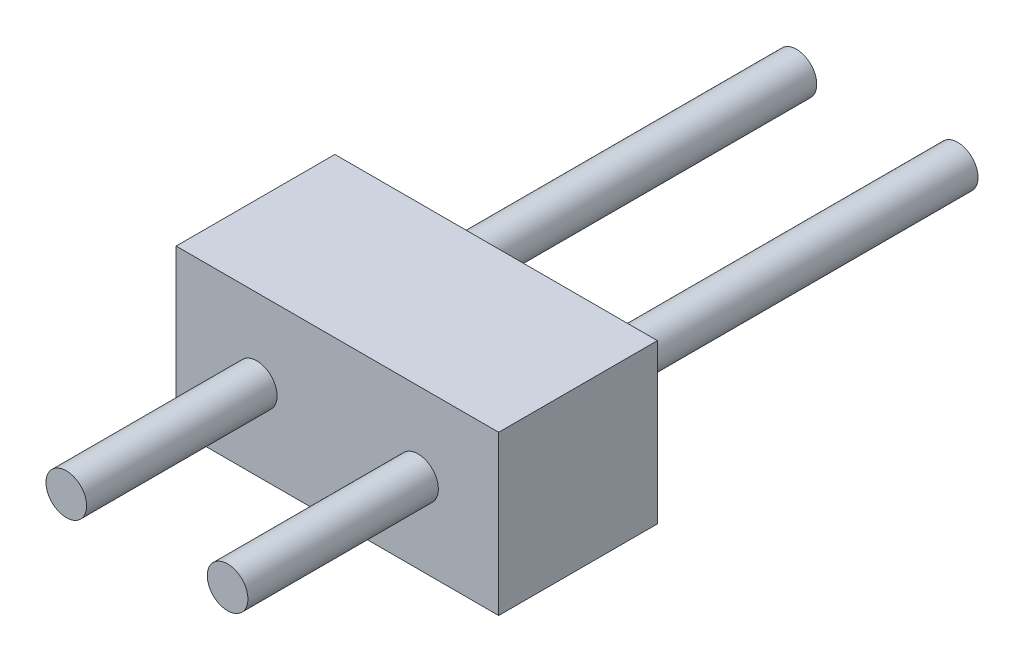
ISO-10303-21;
HEADER;
FILE_DESCRIPTION(('STEP AP214'),'2;1');
FILE_NAME('part.step','',(''),(''),'','','');
FILE_SCHEMA(('AUTOMOTIVE_DESIGN { 1 0 10303 214 1 1 1 1 }'));
ENDSEC;
DATA;
#1=APPLICATION_CONTEXT('core data for automotive mechanical design processes');
#2=APPLICATION_PROTOCOL_DEFINITION('international standard','automotive_design',2000,#1);
#3=PRODUCT_CONTEXT('',#1,'mechanical');
#4=PRODUCT('Part','Part','',(#3));
#5=PRODUCT_RELATED_PRODUCT_CATEGORY('part','',(#4));
#6=PRODUCT_DEFINITION_FORMATION('','',#4);
#7=PRODUCT_DEFINITION_CONTEXT('part definition',#1,'design');
#8=PRODUCT_DEFINITION('design','',#6,#7);
#9=PRODUCT_DEFINITION_SHAPE('','',#8);
#10=(LENGTH_UNIT() NAMED_UNIT(*) SI_UNIT(.MILLI.,.METRE.));
#11=(NAMED_UNIT(*) PLANE_ANGLE_UNIT() SI_UNIT($,.RADIAN.));
#12=(NAMED_UNIT(*) SI_UNIT($,.STERADIAN.) SOLID_ANGLE_UNIT());
#13=UNCERTAINTY_MEASURE_WITH_UNIT(LENGTH_MEASURE(1.E-05),#10,'distance_accuracy_value','');
#14=(GEOMETRIC_REPRESENTATION_CONTEXT(3) GLOBAL_UNCERTAINTY_ASSIGNED_CONTEXT((#13)) GLOBAL_UNIT_ASSIGNED_CONTEXT((#10,
#11,#12)) REPRESENTATION_CONTEXT('',''));
#15=CARTESIAN_POINT('',(0.,0.,0.));
#16=DIRECTION('',(0.,0.,1.));
#17=DIRECTION('',(1.,0.,0.));
#18=AXIS2_PLACEMENT_3D('',#15,#16,#17);
#19=CARTESIAN_POINT('',(0.,0.,2.5));
#20=DIRECTION('',(1.,0.,0.));
#21=DIRECTION('',(0.,0.,-1.));
#22=AXIS2_PLACEMENT_3D('',#19,#20,#21);
#23=PLANE('',#22);
#24=DIRECTION('',(0.,-1.,0.));
#25=VECTOR('',#24,1.);
#26=CARTESIAN_POINT('',(0.,0.,0.));
#27=LINE('',#26,#25);
#28=CARTESIAN_POINT('',(0.,2.5,0.));
#29=VERTEX_POINT('',#28);
#30=CARTESIAN_POINT('',(0.,0.,0.));
#31=VERTEX_POINT('',#30);
#32=EDGE_CURVE('E102',#29,#31,#27,.T.);
#33=ORIENTED_EDGE('',*,*,#32,.T.);
#34=DIRECTION('',(0.,0.,-1.));
#35=VECTOR('',#34,1.);
#36=CARTESIAN_POINT('',(0.,0.,2.5));
#37=LINE('',#36,#35);
#38=CARTESIAN_POINT('',(0.,0.,2.5));
#39=VERTEX_POINT('',#38);
#40=EDGE_CURVE('E93',#39,#31,#37,.T.);
#41=ORIENTED_EDGE('',*,*,#40,.F.);
#42=DIRECTION('',(0.,-1.,0.));
#43=VECTOR('',#42,1.);
#44=CARTESIAN_POINT('',(0.,0.,2.5));
#45=LINE('',#44,#43);
#46=CARTESIAN_POINT('',(0.,2.5,2.5));
#47=VERTEX_POINT('',#46);
#48=EDGE_CURVE('E87',#47,#39,#45,.T.);
#49=ORIENTED_EDGE('',*,*,#48,.F.);
#50=DIRECTION('',(0.,0.,-1.));
#51=VECTOR('',#50,1.);
#52=CARTESIAN_POINT('',(0.,2.5,2.5));
#53=LINE('',#52,#51);
#54=EDGE_CURVE('E98',#47,#29,#53,.T.);
#55=ORIENTED_EDGE('',*,*,#54,.T.);
#56=EDGE_LOOP('',(#33,#41,#49,#55));
#57=FACE_BOUND('',#56,.T.);
#58=ADVANCED_FACE('F35',(#57),#23,.F.);
#59=CARTESIAN_POINT('',(0.,0.,2.5));
#60=DIRECTION('',(0.,1.,0.));
#61=DIRECTION('',(0.,0.,1.));
#62=AXIS2_PLACEMENT_3D('',#59,#60,#61);
#63=PLANE('',#62);
#64=DIRECTION('',(1.,0.,0.));
#65=VECTOR('',#64,1.);
#66=CARTESIAN_POINT('',(0.,0.,0.));
#67=LINE('',#66,#65);
#68=CARTESIAN_POINT('',(5.08,0.,0.));
#69=VERTEX_POINT('',#68);
#70=EDGE_CURVE('E92',#31,#69,#67,.T.);
#71=ORIENTED_EDGE('',*,*,#70,.T.);
#72=DIRECTION('',(0.,0.,-1.));
#73=VECTOR('',#72,1.);
#74=CARTESIAN_POINT('',(5.08,0.,2.5));
#75=LINE('',#74,#73);
#76=CARTESIAN_POINT('',(5.08,0.,2.5));
#77=VERTEX_POINT('',#76);
#78=EDGE_CURVE('E90',#77,#69,#75,.T.);
#79=ORIENTED_EDGE('',*,*,#78,.F.);
#80=DIRECTION('',(1.,0.,0.));
#81=VECTOR('',#80,1.);
#82=CARTESIAN_POINT('',(0.,0.,2.5));
#83=LINE('',#82,#81);
#84=EDGE_CURVE('E82',#39,#77,#83,.T.);
#85=ORIENTED_EDGE('',*,*,#84,.F.);
#86=ORIENTED_EDGE('',*,*,#40,.T.);
#87=EDGE_LOOP('',(#71,#79,#85,#86));
#88=FACE_BOUND('',#87,.T.);
#89=ADVANCED_FACE('F91',(#88),#63,.F.);
#90=CARTESIAN_POINT('',(5.08,0.,2.5));
#91=DIRECTION('',(-1.,0.,0.));
#92=DIRECTION('',(0.,0.,1.));
#93=AXIS2_PLACEMENT_3D('',#90,#91,#92);
#94=PLANE('',#93);
#95=DIRECTION('',(0.,1.,0.));
#96=VECTOR('',#95,1.);
#97=CARTESIAN_POINT('',(5.08,0.,0.));
#98=LINE('',#97,#96);
#99=CARTESIAN_POINT('',(5.08,2.5,0.));
#100=VERTEX_POINT('',#99);
#101=EDGE_CURVE('E68',#69,#100,#98,.T.);
#102=ORIENTED_EDGE('',*,*,#101,.T.);
#103=DIRECTION('',(0.,0.,-1.));
#104=VECTOR('',#103,1.);
#105=CARTESIAN_POINT('',(5.08,2.5,2.5));
#106=LINE('',#105,#104);
#107=CARTESIAN_POINT('',(5.08,2.5,2.5));
#108=VERTEX_POINT('',#107);
#109=EDGE_CURVE('E94',#108,#100,#106,.T.);
#110=ORIENTED_EDGE('',*,*,#109,.F.);
#111=DIRECTION('',(0.,1.,0.));
#112=VECTOR('',#111,1.);
#113=CARTESIAN_POINT('',(5.08,0.,2.5));
#114=LINE('',#113,#112);
#115=EDGE_CURVE('E85',#77,#108,#114,.T.);
#116=ORIENTED_EDGE('',*,*,#115,.F.);
#117=ORIENTED_EDGE('',*,*,#78,.T.);
#118=EDGE_LOOP('',(#102,#110,#116,#117));
#119=FACE_BOUND('',#118,.T.);
#120=ADVANCED_FACE('F96',(#119),#94,.F.);
#121=CARTESIAN_POINT('',(0.,2.5,2.5));
#122=DIRECTION('',(0.,-1.,0.));
#123=DIRECTION('',(0.,0.,-1.));
#124=AXIS2_PLACEMENT_3D('',#121,#122,#123);
#125=PLANE('',#124);
#126=DIRECTION('',(-1.,0.,0.));
#127=VECTOR('',#126,1.);
#128=CARTESIAN_POINT('',(0.,2.5,0.));
#129=LINE('',#128,#127);
#130=EDGE_CURVE('E74',#100,#29,#129,.T.);
#131=ORIENTED_EDGE('',*,*,#130,.T.);
#132=ORIENTED_EDGE('',*,*,#54,.F.);
#133=DIRECTION('',(-1.,0.,0.));
#134=VECTOR('',#133,1.);
#135=CARTESIAN_POINT('',(0.,2.5,2.5));
#136=LINE('',#135,#134);
#137=EDGE_CURVE('E51',#108,#47,#136,.T.);
#138=ORIENTED_EDGE('',*,*,#137,.F.);
#139=ORIENTED_EDGE('',*,*,#109,.T.);
#140=EDGE_LOOP('',(#131,#132,#138,#139));
#141=FACE_BOUND('',#140,.T.);
#142=ADVANCED_FACE('F118',(#141),#125,.F.);
#143=CARTESIAN_POINT('',(0.,0.,2.5));
#144=DIRECTION('',(0.,0.,-1.));
#145=DIRECTION('',(-1.,0.,0.));
#146=AXIS2_PLACEMENT_3D('',#143,#144,#145);
#147=PLANE('',#146);
#148=CARTESIAN_POINT('',(3.81,1.25,2.5));
#149=DIRECTION('',(0.,0.,-1.));
#150=DIRECTION('',(-1.,0.,0.));
#151=AXIS2_PLACEMENT_3D('',#148,#149,#150);
#152=CIRCLE('',#151,0.32);
#153=CARTESIAN_POINT('',(3.49,1.25,2.5));
#154=VERTEX_POINT('',#153);
#155=EDGE_CURVE('E11',#154,#154,#152,.F.);
#156=ORIENTED_EDGE('',*,*,#155,.F.);
#157=EDGE_LOOP('',(#156));
#158=FACE_BOUND('',#157,.T.);
#159=CARTESIAN_POINT('',(1.27,1.25,2.5));
#160=DIRECTION('',(0.,0.,-1.));
#161=DIRECTION('',(-1.,0.,0.));
#162=AXIS2_PLACEMENT_3D('',#159,#160,#161);
#163=CIRCLE('',#162,0.32);
#164=CARTESIAN_POINT('',(0.95,1.25,2.5));
#165=VERTEX_POINT('',#164);
#166=EDGE_CURVE('E43',#165,#165,#163,.F.);
#167=ORIENTED_EDGE('',*,*,#166,.F.);
#168=EDGE_LOOP('',(#167));
#169=FACE_BOUND('',#168,.T.);
#170=ORIENTED_EDGE('',*,*,#48,.T.);
#171=ORIENTED_EDGE('',*,*,#84,.T.);
#172=ORIENTED_EDGE('',*,*,#115,.T.);
#173=ORIENTED_EDGE('',*,*,#137,.T.);
#174=EDGE_LOOP('',(#170,#171,#172,#173));
#175=FACE_BOUND('',#174,.T.);
#176=ADVANCED_FACE('F83',(#158,#169,#175),#147,.F.);
#177=CARTESIAN_POINT('',(0.,0.,0.));
#178=DIRECTION('',(0.,0.,-1.));
#179=DIRECTION('',(-1.,0.,0.));
#180=AXIS2_PLACEMENT_3D('',#177,#178,#179);
#181=PLANE('',#180);
#182=CARTESIAN_POINT('',(3.81,1.25,0.));
#183=DIRECTION('',(0.,0.,-1.));
#184=DIRECTION('',(-1.,0.,0.));
#185=AXIS2_PLACEMENT_3D('',#182,#183,#184);
#186=CIRCLE('',#185,0.32);
#187=CARTESIAN_POINT('',(3.49,1.25,0.));
#188=VERTEX_POINT('',#187);
#189=EDGE_CURVE('E150',#188,#188,#186,.T.);
#190=ORIENTED_EDGE('',*,*,#189,.F.);
#191=EDGE_LOOP('',(#190));
#192=FACE_BOUND('',#191,.T.);
#193=CARTESIAN_POINT('',(1.27,1.25,0.));
#194=DIRECTION('',(0.,0.,-1.));
#195=DIRECTION('',(-1.,0.,0.));
#196=AXIS2_PLACEMENT_3D('',#193,#194,#195);
#197=CIRCLE('',#196,0.32);
#198=CARTESIAN_POINT('',(0.95,1.25,0.));
#199=VERTEX_POINT('',#198);
#200=EDGE_CURVE('E144',#199,#199,#197,.T.);
#201=ORIENTED_EDGE('',*,*,#200,.F.);
#202=EDGE_LOOP('',(#201));
#203=FACE_BOUND('',#202,.T.);
#204=ORIENTED_EDGE('',*,*,#32,.F.);
#205=ORIENTED_EDGE('',*,*,#130,.F.);
#206=ORIENTED_EDGE('',*,*,#101,.F.);
#207=ORIENTED_EDGE('',*,*,#70,.F.);
#208=EDGE_LOOP('',(#204,#205,#206,#207));
#209=FACE_BOUND('',#208,.T.);
#210=ADVANCED_FACE('F117',(#192,#203,#209),#181,.T.);
#211=CARTESIAN_POINT('',(1.27,1.25,5.5));
#212=DIRECTION('',(0.,0.,-1.));
#213=DIRECTION('',(-1.,0.,0.));
#214=AXIS2_PLACEMENT_3D('',#211,#212,#213);
#215=CYLINDRICAL_SURFACE('',#214,0.32);
#216=CARTESIAN_POINT('',(1.27,1.25,5.5));
#217=DIRECTION('',(0.,0.,1.));
#218=DIRECTION('',(1.,0.,0.));
#219=AXIS2_PLACEMENT_3D('',#216,#217,#218);
#220=CIRCLE('',#219,0.32);
#221=CARTESIAN_POINT('',(1.59,1.25,5.5));
#222=VERTEX_POINT('',#221);
#223=EDGE_CURVE('E105',#222,#222,#220,.T.);
#224=ORIENTED_EDGE('',*,*,#223,.F.);
#225=EDGE_LOOP('',(#224));
#226=FACE_BOUND('',#225,.T.);
#227=ORIENTED_EDGE('',*,*,#166,.T.);
#228=EDGE_LOOP('',(#227));
#229=FACE_BOUND('',#228,.T.);
#230=ADVANCED_FACE('F114',(#226,#229),#215,.T.);
#231=CARTESIAN_POINT('',(1.27,1.25,5.5));
#232=DIRECTION('',(0.,0.,1.));
#233=DIRECTION('',(1.,0.,0.));
#234=AXIS2_PLACEMENT_3D('',#231,#232,#233);
#235=PLANE('',#234);
#236=ORIENTED_EDGE('',*,*,#223,.T.);
#237=EDGE_LOOP('',(#236));
#238=FACE_BOUND('',#237,.T.);
#239=ADVANCED_FACE('F185',(#238),#235,.T.);
#240=CARTESIAN_POINT('',(3.81,1.25,5.5));
#241=DIRECTION('',(0.,0.,-1.));
#242=DIRECTION('',(-1.,0.,0.));
#243=AXIS2_PLACEMENT_3D('',#240,#241,#242);
#244=CYLINDRICAL_SURFACE('',#243,0.32);
#245=CARTESIAN_POINT('',(3.81,1.25,5.5));
#246=DIRECTION('',(0.,0.,1.));
#247=DIRECTION('',(-1.,0.,0.));
#248=AXIS2_PLACEMENT_3D('',#245,#246,#247);
#249=CIRCLE('',#248,0.32);
#250=CARTESIAN_POINT('',(3.49,1.25,5.5));
#251=VERTEX_POINT('',#250);
#252=EDGE_CURVE('E140',#251,#251,#249,.T.);
#253=ORIENTED_EDGE('',*,*,#252,.F.);
#254=EDGE_LOOP('',(#253));
#255=FACE_BOUND('',#254,.T.);
#256=ORIENTED_EDGE('',*,*,#155,.T.);
#257=EDGE_LOOP('',(#256));
#258=FACE_BOUND('',#257,.T.);
#259=ADVANCED_FACE('F178',(#255,#258),#244,.T.);
#260=CARTESIAN_POINT('',(3.81,1.25,5.5));
#261=DIRECTION('',(0.,0.,-1.));
#262=DIRECTION('',(-1.,0.,0.));
#263=AXIS2_PLACEMENT_3D('',#260,#261,#262);
#264=PLANE('',#263);
#265=ORIENTED_EDGE('',*,*,#252,.T.);
#266=EDGE_LOOP('',(#265));
#267=FACE_BOUND('',#266,.T.);
#268=ADVANCED_FACE('F169',(#267),#264,.F.);
#269=CARTESIAN_POINT('',(1.27,1.25,-6.));
#270=DIRECTION('',(0.,0.,1.));
#271=DIRECTION('',(1.,0.,0.));
#272=AXIS2_PLACEMENT_3D('',#269,#270,#271);
#273=CYLINDRICAL_SURFACE('',#272,0.32);
#274=CARTESIAN_POINT('',(1.27,1.25,-6.));
#275=DIRECTION('',(0.,0.,-1.));
#276=DIRECTION('',(-1.,0.,0.));
#277=AXIS2_PLACEMENT_3D('',#274,#275,#276);
#278=CIRCLE('',#277,0.32);
#279=CARTESIAN_POINT('',(0.95,1.25,-6.));
#280=VERTEX_POINT('',#279);
#281=EDGE_CURVE('E143',#280,#280,#278,.T.);
#282=ORIENTED_EDGE('',*,*,#281,.F.);
#283=EDGE_LOOP('',(#282));
#284=FACE_BOUND('',#283,.T.);
#285=ORIENTED_EDGE('',*,*,#200,.T.);
#286=EDGE_LOOP('',(#285));
#287=FACE_BOUND('',#286,.T.);
#288=ADVANCED_FACE('F167',(#284,#287),#273,.T.);
#289=CARTESIAN_POINT('',(1.27,1.25,-6.));
#290=DIRECTION('',(0.,0.,-1.));
#291=DIRECTION('',(-1.,0.,0.));
#292=AXIS2_PLACEMENT_3D('',#289,#290,#291);
#293=PLANE('',#292);
#294=ORIENTED_EDGE('',*,*,#281,.T.);
#295=EDGE_LOOP('',(#294));
#296=FACE_BOUND('',#295,.T.);
#297=ADVANCED_FACE('F161',(#296),#293,.T.);
#298=CARTESIAN_POINT('',(3.81,1.25,-6.));
#299=DIRECTION('',(0.,0.,1.));
#300=DIRECTION('',(1.,0.,0.));
#301=AXIS2_PLACEMENT_3D('',#298,#299,#300);
#302=CYLINDRICAL_SURFACE('',#301,0.32);
#303=CARTESIAN_POINT('',(3.81,1.25,-6.));
#304=DIRECTION('',(0.,0.,-1.));
#305=DIRECTION('',(-1.,0.,0.));
#306=AXIS2_PLACEMENT_3D('',#303,#304,#305);
#307=CIRCLE('',#306,0.32);
#308=CARTESIAN_POINT('',(3.49,1.25,-6.));
#309=VERTEX_POINT('',#308);
#310=EDGE_CURVE('E147',#309,#309,#307,.T.);
#311=ORIENTED_EDGE('',*,*,#310,.F.);
#312=EDGE_LOOP('',(#311));
#313=FACE_BOUND('',#312,.T.);
#314=ORIENTED_EDGE('',*,*,#189,.T.);
#315=EDGE_LOOP('',(#314));
#316=FACE_BOUND('',#315,.T.);
#317=ADVANCED_FACE('F158',(#313,#316),#302,.T.);
#318=CARTESIAN_POINT('',(3.81,1.25,-6.));
#319=DIRECTION('',(0.,0.,-1.));
#320=DIRECTION('',(-1.,0.,0.));
#321=AXIS2_PLACEMENT_3D('',#318,#319,#320);
#322=PLANE('',#321);
#323=ORIENTED_EDGE('',*,*,#310,.T.);
#324=EDGE_LOOP('',(#323));
#325=FACE_BOUND('',#324,.T.);
#326=ADVANCED_FACE('F156',(#325),#322,.T.);
#327=CLOSED_SHELL('',(#58,#89,#120,#142,#176,#210,#230,#239,#259,#268,#288,#297,#317,#326));
#328=MANIFOLD_SOLID_BREP('B2',#327);
#329=ADVANCED_BREP_SHAPE_REPRESENTATION('',(#18,#328),#14);
#330=SHAPE_DEFINITION_REPRESENTATION(#9,#329);
ENDSEC;
END-ISO-10303-21;
